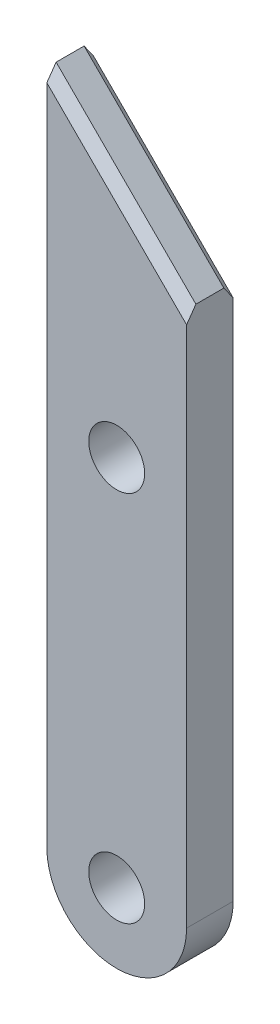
from build123d import *

# Parameters (mm, degrees)
EXTRUSION1_DEPTH        = 10
ESQUISSE2_R             = 6
ENL_V_MAT_EXTRU_1_DEPTH = 10
CHANFREIN1_SIZE         = 2


with BuildPart() as part:
    # Esquisse1 → Extrusion1 (new body)
    with BuildSketch(Plane.XY):
        with BuildLine():
            Line((0, 0), (30, -30))
            Line((30, -30), (30, -145))
            ThreePointArc((30, -145), (15, -160), (0, -145))
            Line((0, -145), (0, 0))
        make_face()
    extrude(amount=EXTRUSION1_DEPTH)

    # Esquisse2 → Enl_v. mat.-Extru.1 (cut)
    with BuildSketch(Plane.XY.offset(10)):
        with Locations((15, -145)):
            Circle(ESQUISSE2_R)
        with Locations((15, -65)):
            Circle(ESQUISSE2_R)
    extrude(amount=-ENL_V_MAT_EXTRU_1_DEPTH, mode=Mode.SUBTRACT)

    # Chanfrein1
    chanfrein1_edges = [part.edges().sort_by_distance(p)[0] for p in [
        (15, -15, 10),
        (15, -15, 0),
    ]]
    chamfer(chanfrein1_edges, length=CHANFREIN1_SIZE)


solid = part.part
